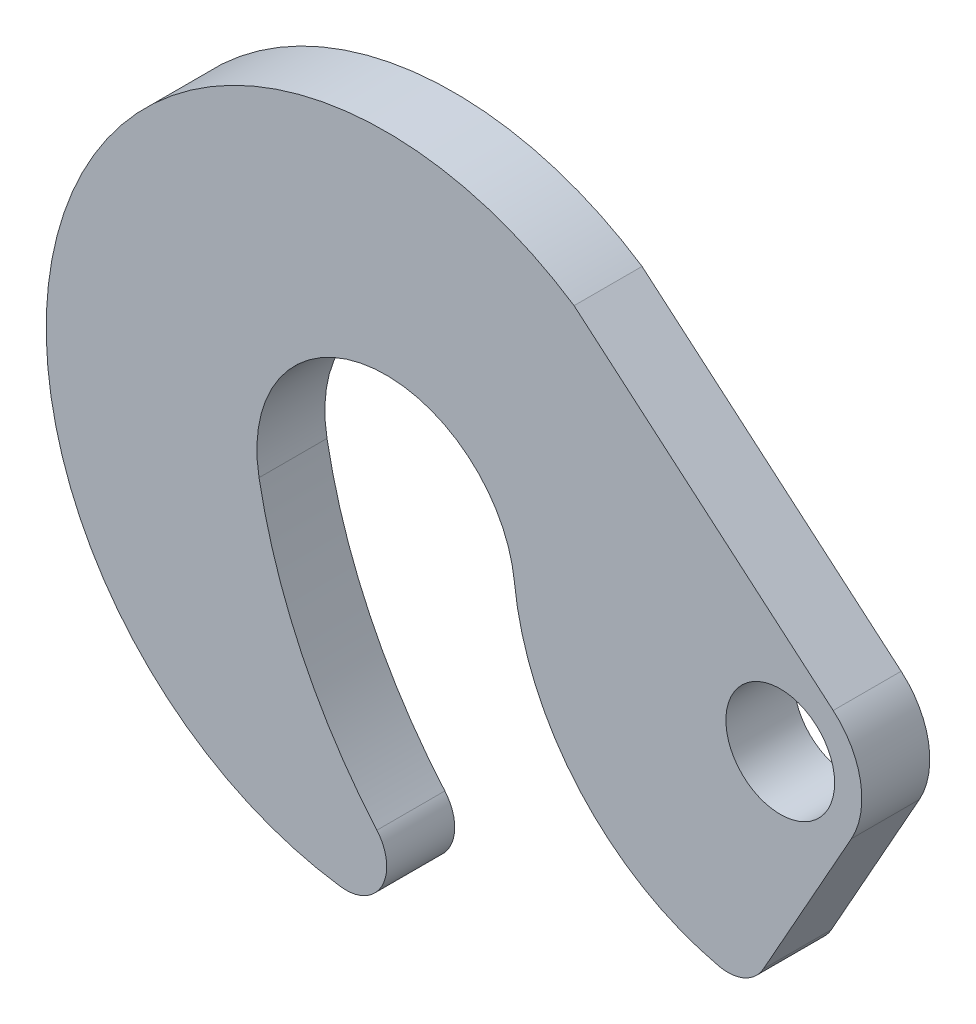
ISO-10303-21;
HEADER;
FILE_DESCRIPTION(('STEP AP214'),'2;1');
FILE_NAME('part.step','',(''),(''),'','','');
FILE_SCHEMA(('AUTOMOTIVE_DESIGN { 1 0 10303 214 1 1 1 1 }'));
ENDSEC;
DATA;
#1=APPLICATION_CONTEXT('core data for automotive mechanical design processes');
#2=APPLICATION_PROTOCOL_DEFINITION('international standard','automotive_design',2000,#1);
#3=PRODUCT_CONTEXT('',#1,'mechanical');
#4=PRODUCT('Part','Part','',(#3));
#5=PRODUCT_RELATED_PRODUCT_CATEGORY('part','',(#4));
#6=PRODUCT_DEFINITION_FORMATION('','',#4);
#7=PRODUCT_DEFINITION_CONTEXT('part definition',#1,'design');
#8=PRODUCT_DEFINITION('design','',#6,#7);
#9=PRODUCT_DEFINITION_SHAPE('','',#8);
#10=(LENGTH_UNIT() NAMED_UNIT(*) SI_UNIT(.MILLI.,.METRE.));
#11=(NAMED_UNIT(*) PLANE_ANGLE_UNIT() SI_UNIT($,.RADIAN.));
#12=(NAMED_UNIT(*) SI_UNIT($,.STERADIAN.) SOLID_ANGLE_UNIT());
#13=UNCERTAINTY_MEASURE_WITH_UNIT(LENGTH_MEASURE(1.E-05),#10,'distance_accuracy_value','');
#14=(GEOMETRIC_REPRESENTATION_CONTEXT(3) GLOBAL_UNCERTAINTY_ASSIGNED_CONTEXT((#13)) GLOBAL_UNIT_ASSIGNED_CONTEXT((#10,
#11,#12)) REPRESENTATION_CONTEXT('',''));
#15=CARTESIAN_POINT('',(0.,0.,0.));
#16=DIRECTION('',(0.,0.,1.));
#17=DIRECTION('',(1.,0.,0.));
#18=AXIS2_PLACEMENT_3D('',#15,#16,#17);
#19=CARTESIAN_POINT('',(0.,0.,10.));
#20=DIRECTION('',(0.,0.,1.));
#21=DIRECTION('',(1.,0.,0.));
#22=AXIS2_PLACEMENT_3D('',#19,#20,#21);
#23=PLANE('',#22);
#24=CARTESIAN_POINT('',(0.,0.,10.));
#25=DIRECTION('',(0.,0.,1.));
#26=DIRECTION('',(1.,0.,0.));
#27=AXIS2_PLACEMENT_3D('',#24,#25,#26);
#28=CIRCLE('',#27,50.);
#29=CARTESIAN_POINT('',(27.6634537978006,41.6501299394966,10.));
#30=VERTEX_POINT('',#29);
#31=CARTESIAN_POINT('',(-6.70013629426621,-49.5490481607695,10.));
#32=VERTEX_POINT('',#31);
#33=EDGE_CURVE('E153',#30,#32,#28,.T.);
#34=ORIENTED_EDGE('',*,*,#33,.T.);
#35=CARTESIAN_POINT('',(-5.89611993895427,-43.6031623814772,10.));
#36=DIRECTION('',(0.,0.,1.));
#37=DIRECTION('',(1.,0.,0.));
#38=AXIS2_PLACEMENT_3D('',#35,#36,#37);
#39=CIRCLE('',#38,6.);
#40=CARTESIAN_POINT('',(-1.34650872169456,-39.6915082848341,10.));
#41=VERTEX_POINT('',#40);
#42=EDGE_CURVE('E96',#32,#41,#39,.T.);
#43=ORIENTED_EDGE('',*,*,#42,.T.);
#44=CARTESIAN_POINT('',(57.0401685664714,10.5080526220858,10.));
#45=DIRECTION('',(0.,0.,-1.));
#46=DIRECTION('',(-1.,0.,0.));
#47=AXIS2_PLACEMENT_3D('',#44,#45,#46);
#48=CIRCLE('',#47,77.);
#49=CARTESIAN_POINT('',(-18.6855724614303,-3.44229310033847,10.));
#50=VERTEX_POINT('',#49);
#51=EDGE_CURVE('E171',#41,#50,#48,.T.);
#52=ORIENTED_EDGE('',*,*,#51,.T.);
#53=CARTESIAN_POINT('',(0.,0.,10.));
#54=DIRECTION('',(0.,0.,-1.));
#55=DIRECTION('',(-1.,0.,0.));
#56=AXIS2_PLACEMENT_3D('',#53,#54,#55);
#57=CIRCLE('',#56,19.);
#58=CARTESIAN_POINT('',(18.8924391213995,2.01884720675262,10.));
#59=VERTEX_POINT('',#58);
#60=EDGE_CURVE('E188',#50,#59,#57,.T.);
#61=ORIENTED_EDGE('',*,*,#60,.T.);
#62=CARTESIAN_POINT('',(57.6716562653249,6.16279673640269,10.));
#63=DIRECTION('',(0.,0.,1.));
#64=DIRECTION('',(1.,0.,0.));
#65=AXIS2_PLACEMENT_3D('',#62,#63,#64);
#66=CIRCLE('',#65,39.);
#67=CARTESIAN_POINT('',(48.9426263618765,-31.8477812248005,10.));
#68=VERTEX_POINT('',#67);
#69=EDGE_CURVE('E187',#59,#68,#66,.T.);
#70=ORIENTED_EDGE('',*,*,#69,.T.);
#71=CARTESIAN_POINT('',(50.2855540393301,-26.,10.));
#72=DIRECTION('',(0.,0.,1.));
#73=DIRECTION('',(1.,0.,0.));
#74=AXIS2_PLACEMENT_3D('',#71,#72,#73);
#75=CIRCLE('',#74,6.);
#76=CARTESIAN_POINT('',(55.5175713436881,-28.9370044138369,10.));
#77=VERTEX_POINT('',#76);
#78=EDGE_CURVE('E118',#68,#77,#75,.T.);
#79=ORIENTED_EDGE('',*,*,#78,.T.);
#80=DIRECTION('',(0.48950073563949,0.872002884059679,0.));
#81=VECTOR('',#80,1.);
#82=CARTESIAN_POINT('',(55.5175713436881,-28.9370044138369,10.));
#83=LINE('',#82,#81);
#84=CARTESIAN_POINT('',(68.4640346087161,-5.87400882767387,10.));
#85=VERTEX_POINT('',#84);
#86=EDGE_CURVE('E112',#77,#85,#83,.T.);
#87=ORIENTED_EDGE('',*,*,#86,.T.);
#88=CARTESIAN_POINT('',(58.,0.,10.));
#89=DIRECTION('',(0.,0.,1.));
#90=DIRECTION('',(1.,0.,0.));
#91=AXIS2_PLACEMENT_3D('',#88,#89,#90);
#92=CIRCLE('',#91,12.);
#93=CARTESIAN_POINT('',(65.7877299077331,9.12969128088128,10.));
#94=VERTEX_POINT('',#93);
#95=EDGE_CURVE('E116',#85,#94,#92,.T.);
#96=ORIENTED_EDGE('',*,*,#95,.T.);
#97=DIRECTION('',(-0.760807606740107,0.64897749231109,0.));
#98=VECTOR('',#97,1.);
#99=CARTESIAN_POINT('',(27.6634537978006,41.6501299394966,10.));
#100=LINE('',#99,#98);
#101=EDGE_CURVE('E50',#94,#30,#100,.T.);
#102=ORIENTED_EDGE('',*,*,#101,.T.);
#103=EDGE_LOOP('',(#34,#43,#52,#61,#70,#79,#87,#96,#102));
#104=FACE_BOUND('',#103,.T.);
#105=CARTESIAN_POINT('',(58.,0.,10.));
#106=DIRECTION('',(0.,0.,1.));
#107=DIRECTION('',(1.,0.,0.));
#108=AXIS2_PLACEMENT_3D('',#105,#106,#107);
#109=CIRCLE('',#108,8.00000000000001);
#110=CARTESIAN_POINT('',(66.,0.,10.));
#111=VERTEX_POINT('',#110);
#112=EDGE_CURVE('E140',#111,#111,#109,.T.);
#113=ORIENTED_EDGE('',*,*,#112,.F.);
#114=EDGE_LOOP('',(#113));
#115=FACE_BOUND('',#114,.T.);
#116=ADVANCED_FACE('F33',(#104,#115),#23,.T.);
#117=CARTESIAN_POINT('',(0.,0.,0.));
#118=DIRECTION('',(0.,0.,1.));
#119=DIRECTION('',(1.,0.,0.));
#120=AXIS2_PLACEMENT_3D('',#117,#118,#119);
#121=PLANE('',#120);
#122=CARTESIAN_POINT('',(0.,0.,0.));
#123=DIRECTION('',(0.,0.,1.));
#124=DIRECTION('',(1.,0.,0.));
#125=AXIS2_PLACEMENT_3D('',#122,#123,#124);
#126=CIRCLE('',#125,50.);
#127=CARTESIAN_POINT('',(27.6634537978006,41.6501299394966,0.));
#128=VERTEX_POINT('',#127);
#129=CARTESIAN_POINT('',(-6.70013629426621,-49.5490481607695,0.));
#130=VERTEX_POINT('',#129);
#131=EDGE_CURVE('E136',#128,#130,#126,.T.);
#132=ORIENTED_EDGE('',*,*,#131,.F.);
#133=DIRECTION('',(-0.760807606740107,0.64897749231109,0.));
#134=VECTOR('',#133,1.);
#135=CARTESIAN_POINT('',(27.6634537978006,41.6501299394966,0.));
#136=LINE('',#135,#134);
#137=CARTESIAN_POINT('',(65.7877299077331,9.12969128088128,0.));
#138=VERTEX_POINT('',#137);
#139=EDGE_CURVE('E88',#138,#128,#136,.T.);
#140=ORIENTED_EDGE('',*,*,#139,.F.);
#141=CARTESIAN_POINT('',(58.,0.,0.));
#142=DIRECTION('',(0.,0.,1.));
#143=DIRECTION('',(1.,0.,0.));
#144=AXIS2_PLACEMENT_3D('',#141,#142,#143);
#145=CIRCLE('',#144,12.);
#146=CARTESIAN_POINT('',(68.4640346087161,-5.87400882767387,0.));
#147=VERTEX_POINT('',#146);
#148=EDGE_CURVE('E82',#147,#138,#145,.T.);
#149=ORIENTED_EDGE('',*,*,#148,.F.);
#150=DIRECTION('',(0.48950073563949,0.872002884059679,0.));
#151=VECTOR('',#150,1.);
#152=CARTESIAN_POINT('',(55.5175713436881,-28.9370044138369,0.));
#153=LINE('',#152,#151);
#154=CARTESIAN_POINT('',(55.5175713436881,-28.9370044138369,0.));
#155=VERTEX_POINT('',#154);
#156=EDGE_CURVE('E126',#155,#147,#153,.T.);
#157=ORIENTED_EDGE('',*,*,#156,.F.);
#158=CARTESIAN_POINT('',(50.2855540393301,-26.,0.));
#159=DIRECTION('',(0.,0.,1.));
#160=DIRECTION('',(1.,0.,0.));
#161=AXIS2_PLACEMENT_3D('',#158,#159,#160);
#162=CIRCLE('',#161,6.);
#163=CARTESIAN_POINT('',(48.9426263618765,-31.8477812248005,0.));
#164=VERTEX_POINT('',#163);
#165=EDGE_CURVE('E148',#164,#155,#162,.T.);
#166=ORIENTED_EDGE('',*,*,#165,.F.);
#167=CARTESIAN_POINT('',(57.6716562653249,6.16279673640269,0.));
#168=DIRECTION('',(0.,0.,1.));
#169=DIRECTION('',(1.,0.,0.));
#170=AXIS2_PLACEMENT_3D('',#167,#168,#169);
#171=CIRCLE('',#170,39.);
#172=CARTESIAN_POINT('',(18.8924391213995,2.01884720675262,0.));
#173=VERTEX_POINT('',#172);
#174=EDGE_CURVE('E146',#173,#164,#171,.T.);
#175=ORIENTED_EDGE('',*,*,#174,.F.);
#176=CARTESIAN_POINT('',(0.,0.,0.));
#177=DIRECTION('',(0.,0.,-1.));
#178=DIRECTION('',(-1.,0.,0.));
#179=AXIS2_PLACEMENT_3D('',#176,#177,#178);
#180=CIRCLE('',#179,19.);
#181=CARTESIAN_POINT('',(-18.6855724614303,-3.44229310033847,0.));
#182=VERTEX_POINT('',#181);
#183=EDGE_CURVE('E144',#182,#173,#180,.T.);
#184=ORIENTED_EDGE('',*,*,#183,.F.);
#185=CARTESIAN_POINT('',(57.0401685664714,10.5080526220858,0.));
#186=DIRECTION('',(0.,0.,-1.));
#187=DIRECTION('',(-1.,0.,0.));
#188=AXIS2_PLACEMENT_3D('',#185,#186,#187);
#189=CIRCLE('',#188,77.);
#190=CARTESIAN_POINT('',(-1.34650872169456,-39.6915082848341,0.));
#191=VERTEX_POINT('',#190);
#192=EDGE_CURVE('E142',#191,#182,#189,.T.);
#193=ORIENTED_EDGE('',*,*,#192,.F.);
#194=CARTESIAN_POINT('',(-5.89611993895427,-43.6031623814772,0.));
#195=DIRECTION('',(0.,0.,1.));
#196=DIRECTION('',(1.,0.,0.));
#197=AXIS2_PLACEMENT_3D('',#194,#195,#196);
#198=CIRCLE('',#197,6.);
#199=EDGE_CURVE('E139',#130,#191,#198,.T.);
#200=ORIENTED_EDGE('',*,*,#199,.F.);
#201=EDGE_LOOP('',(#132,#140,#149,#157,#166,#175,#184,#193,#200));
#202=FACE_BOUND('',#201,.T.);
#203=CARTESIAN_POINT('',(58.,0.,0.));
#204=DIRECTION('',(0.,0.,1.));
#205=DIRECTION('',(1.,0.,0.));
#206=AXIS2_PLACEMENT_3D('',#203,#204,#205);
#207=CIRCLE('',#206,8.00000000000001);
#208=CARTESIAN_POINT('',(66.,0.,0.));
#209=VERTEX_POINT('',#208);
#210=EDGE_CURVE('E195',#209,#209,#207,.T.);
#211=ORIENTED_EDGE('',*,*,#210,.T.);
#212=EDGE_LOOP('',(#211));
#213=FACE_BOUND('',#212,.T.);
#214=ADVANCED_FACE('F175',(#202,#213),#121,.F.);
#215=CARTESIAN_POINT('',(0.,0.,10.));
#216=DIRECTION('',(0.,0.,-1.));
#217=DIRECTION('',(-1.,0.,0.));
#218=AXIS2_PLACEMENT_3D('',#215,#216,#217);
#219=CYLINDRICAL_SURFACE('',#218,50.);
#220=ORIENTED_EDGE('',*,*,#131,.T.);
#221=DIRECTION('',(0.,0.,-1.));
#222=VECTOR('',#221,1.);
#223=CARTESIAN_POINT('',(-6.70013629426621,-49.5490481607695,10.));
#224=LINE('',#223,#222);
#225=EDGE_CURVE('E11',#32,#130,#224,.T.);
#226=ORIENTED_EDGE('',*,*,#225,.F.);
#227=ORIENTED_EDGE('',*,*,#33,.F.);
#228=DIRECTION('',(0.,0.,-1.));
#229=VECTOR('',#228,1.);
#230=CARTESIAN_POINT('',(27.6634537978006,41.6501299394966,10.));
#231=LINE('',#230,#229);
#232=EDGE_CURVE('E132',#30,#128,#231,.T.);
#233=ORIENTED_EDGE('',*,*,#232,.T.);
#234=EDGE_LOOP('',(#220,#226,#227,#233));
#235=FACE_BOUND('',#234,.T.);
#236=ADVANCED_FACE('F35',(#235),#219,.T.);
#237=CARTESIAN_POINT('',(-5.89611993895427,-43.6031623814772,10.));
#238=DIRECTION('',(0.,0.,-1.));
#239=DIRECTION('',(-1.,0.,0.));
#240=AXIS2_PLACEMENT_3D('',#237,#238,#239);
#241=CYLINDRICAL_SURFACE('',#240,6.);
#242=ORIENTED_EDGE('',*,*,#199,.T.);
#243=DIRECTION('',(0.,0.,-1.));
#244=VECTOR('',#243,1.);
#245=CARTESIAN_POINT('',(-1.34650872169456,-39.6915082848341,10.));
#246=LINE('',#245,#244);
#247=EDGE_CURVE('E42',#41,#191,#246,.T.);
#248=ORIENTED_EDGE('',*,*,#247,.F.);
#249=ORIENTED_EDGE('',*,*,#42,.F.);
#250=ORIENTED_EDGE('',*,*,#225,.T.);
#251=EDGE_LOOP('',(#242,#248,#249,#250));
#252=FACE_BOUND('',#251,.T.);
#253=ADVANCED_FACE('F227',(#252),#241,.T.);
#254=CARTESIAN_POINT('',(57.0401685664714,10.5080526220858,10.));
#255=DIRECTION('',(0.,0.,-1.));
#256=DIRECTION('',(-1.,0.,0.));
#257=AXIS2_PLACEMENT_3D('',#254,#255,#256);
#258=CYLINDRICAL_SURFACE('',#257,77.);
#259=ORIENTED_EDGE('',*,*,#192,.T.);
#260=DIRECTION('',(0.,0.,-1.));
#261=VECTOR('',#260,1.);
#262=CARTESIAN_POINT('',(-18.6855724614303,-3.44229310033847,10.));
#263=LINE('',#262,#261);
#264=EDGE_CURVE('E163',#50,#182,#263,.T.);
#265=ORIENTED_EDGE('',*,*,#264,.F.);
#266=ORIENTED_EDGE('',*,*,#51,.F.);
#267=ORIENTED_EDGE('',*,*,#247,.T.);
#268=EDGE_LOOP('',(#259,#265,#266,#267));
#269=FACE_BOUND('',#268,.T.);
#270=ADVANCED_FACE('F169',(#269),#258,.F.);
#271=CARTESIAN_POINT('',(0.,0.,10.));
#272=DIRECTION('',(0.,0.,-1.));
#273=DIRECTION('',(-1.,0.,0.));
#274=AXIS2_PLACEMENT_3D('',#271,#272,#273);
#275=CYLINDRICAL_SURFACE('',#274,19.);
#276=ORIENTED_EDGE('',*,*,#183,.T.);
#277=DIRECTION('',(0.,0.,-1.));
#278=VECTOR('',#277,1.);
#279=CARTESIAN_POINT('',(18.8924391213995,2.01884720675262,10.));
#280=LINE('',#279,#278);
#281=EDGE_CURVE('E160',#59,#173,#280,.T.);
#282=ORIENTED_EDGE('',*,*,#281,.F.);
#283=ORIENTED_EDGE('',*,*,#60,.F.);
#284=ORIENTED_EDGE('',*,*,#264,.T.);
#285=EDGE_LOOP('',(#276,#282,#283,#284));
#286=FACE_BOUND('',#285,.T.);
#287=ADVANCED_FACE('F181',(#286),#275,.F.);
#288=CARTESIAN_POINT('',(57.6716562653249,6.16279673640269,10.));
#289=DIRECTION('',(0.,0.,-1.));
#290=DIRECTION('',(-1.,0.,0.));
#291=AXIS2_PLACEMENT_3D('',#288,#289,#290);
#292=CYLINDRICAL_SURFACE('',#291,39.);
#293=ORIENTED_EDGE('',*,*,#174,.T.);
#294=DIRECTION('',(0.,0.,-1.));
#295=VECTOR('',#294,1.);
#296=CARTESIAN_POINT('',(48.9426263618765,-31.8477812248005,10.));
#297=LINE('',#296,#295);
#298=EDGE_CURVE('E157',#68,#164,#297,.T.);
#299=ORIENTED_EDGE('',*,*,#298,.F.);
#300=ORIENTED_EDGE('',*,*,#69,.F.);
#301=ORIENTED_EDGE('',*,*,#281,.T.);
#302=EDGE_LOOP('',(#293,#299,#300,#301));
#303=FACE_BOUND('',#302,.T.);
#304=ADVANCED_FACE('F185',(#303),#292,.T.);
#305=CARTESIAN_POINT('',(50.2855540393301,-26.,10.));
#306=DIRECTION('',(0.,0.,-1.));
#307=DIRECTION('',(-1.,0.,0.));
#308=AXIS2_PLACEMENT_3D('',#305,#306,#307);
#309=CYLINDRICAL_SURFACE('',#308,6.);
#310=ORIENTED_EDGE('',*,*,#165,.T.);
#311=DIRECTION('',(0.,0.,-1.));
#312=VECTOR('',#311,1.);
#313=CARTESIAN_POINT('',(55.5175713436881,-28.9370044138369,10.));
#314=LINE('',#313,#312);
#315=EDGE_CURVE('E127',#77,#155,#314,.T.);
#316=ORIENTED_EDGE('',*,*,#315,.F.);
#317=ORIENTED_EDGE('',*,*,#78,.F.);
#318=ORIENTED_EDGE('',*,*,#298,.T.);
#319=EDGE_LOOP('',(#310,#316,#317,#318));
#320=FACE_BOUND('',#319,.T.);
#321=ADVANCED_FACE('F218',(#320),#309,.T.);
#322=CARTESIAN_POINT('',(55.5175713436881,-28.9370044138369,10.));
#323=DIRECTION('',(-0.872002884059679,0.48950073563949,0.));
#324=DIRECTION('',(-0.48950073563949,-0.872002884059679,0.));
#325=AXIS2_PLACEMENT_3D('',#322,#323,#324);
#326=PLANE('',#325);
#327=ORIENTED_EDGE('',*,*,#156,.T.);
#328=DIRECTION('',(0.,0.,-1.));
#329=VECTOR('',#328,1.);
#330=CARTESIAN_POINT('',(68.4640346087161,-5.87400882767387,10.));
#331=LINE('',#330,#329);
#332=EDGE_CURVE('E123',#85,#147,#331,.T.);
#333=ORIENTED_EDGE('',*,*,#332,.F.);
#334=ORIENTED_EDGE('',*,*,#86,.F.);
#335=ORIENTED_EDGE('',*,*,#315,.T.);
#336=EDGE_LOOP('',(#327,#333,#334,#335));
#337=FACE_BOUND('',#336,.T.);
#338=ADVANCED_FACE('F124',(#337),#326,.F.);
#339=CARTESIAN_POINT('',(58.,0.,10.));
#340=DIRECTION('',(0.,0.,-1.));
#341=DIRECTION('',(-1.,0.,0.));
#342=AXIS2_PLACEMENT_3D('',#339,#340,#341);
#343=CYLINDRICAL_SURFACE('',#342,12.);
#344=ORIENTED_EDGE('',*,*,#148,.T.);
#345=DIRECTION('',(0.,0.,-1.));
#346=VECTOR('',#345,1.);
#347=CARTESIAN_POINT('',(65.7877299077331,9.12969128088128,10.));
#348=LINE('',#347,#346);
#349=EDGE_CURVE('E128',#94,#138,#348,.T.);
#350=ORIENTED_EDGE('',*,*,#349,.F.);
#351=ORIENTED_EDGE('',*,*,#95,.F.);
#352=ORIENTED_EDGE('',*,*,#332,.T.);
#353=EDGE_LOOP('',(#344,#350,#351,#352));
#354=FACE_BOUND('',#353,.T.);
#355=ADVANCED_FACE('F130',(#354),#343,.T.);
#356=CARTESIAN_POINT('',(27.6634537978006,41.6501299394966,10.));
#357=DIRECTION('',(-0.64897749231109,-0.760807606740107,0.));
#358=DIRECTION('',(0.760807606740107,-0.64897749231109,0.));
#359=AXIS2_PLACEMENT_3D('',#356,#357,#358);
#360=PLANE('',#359);
#361=ORIENTED_EDGE('',*,*,#139,.T.);
#362=ORIENTED_EDGE('',*,*,#232,.F.);
#363=ORIENTED_EDGE('',*,*,#101,.F.);
#364=ORIENTED_EDGE('',*,*,#349,.T.);
#365=EDGE_LOOP('',(#361,#362,#363,#364));
#366=FACE_BOUND('',#365,.T.);
#367=ADVANCED_FACE('F211',(#366),#360,.F.);
#368=CARTESIAN_POINT('',(58.,0.,10.));
#369=DIRECTION('',(0.,0.,-1.));
#370=DIRECTION('',(-1.,0.,0.));
#371=AXIS2_PLACEMENT_3D('',#368,#369,#370);
#372=CYLINDRICAL_SURFACE('',#371,8.00000000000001);
#373=ORIENTED_EDGE('',*,*,#112,.T.);
#374=EDGE_LOOP('',(#373));
#375=FACE_BOUND('',#374,.T.);
#376=ORIENTED_EDGE('',*,*,#210,.F.);
#377=EDGE_LOOP('',(#376));
#378=FACE_BOUND('',#377,.T.);
#379=ADVANCED_FACE('F201',(#375,#378),#372,.F.);
#380=CLOSED_SHELL('',(#116,#214,#236,#253,#270,#287,#304,#321,#338,#355,#367,#379));
#381=MANIFOLD_SOLID_BREP('B2',#380);
#382=ADVANCED_BREP_SHAPE_REPRESENTATION('',(#18,#381),#14);
#383=SHAPE_DEFINITION_REPRESENTATION(#9,#382);
ENDSEC;
END-ISO-10303-21;
